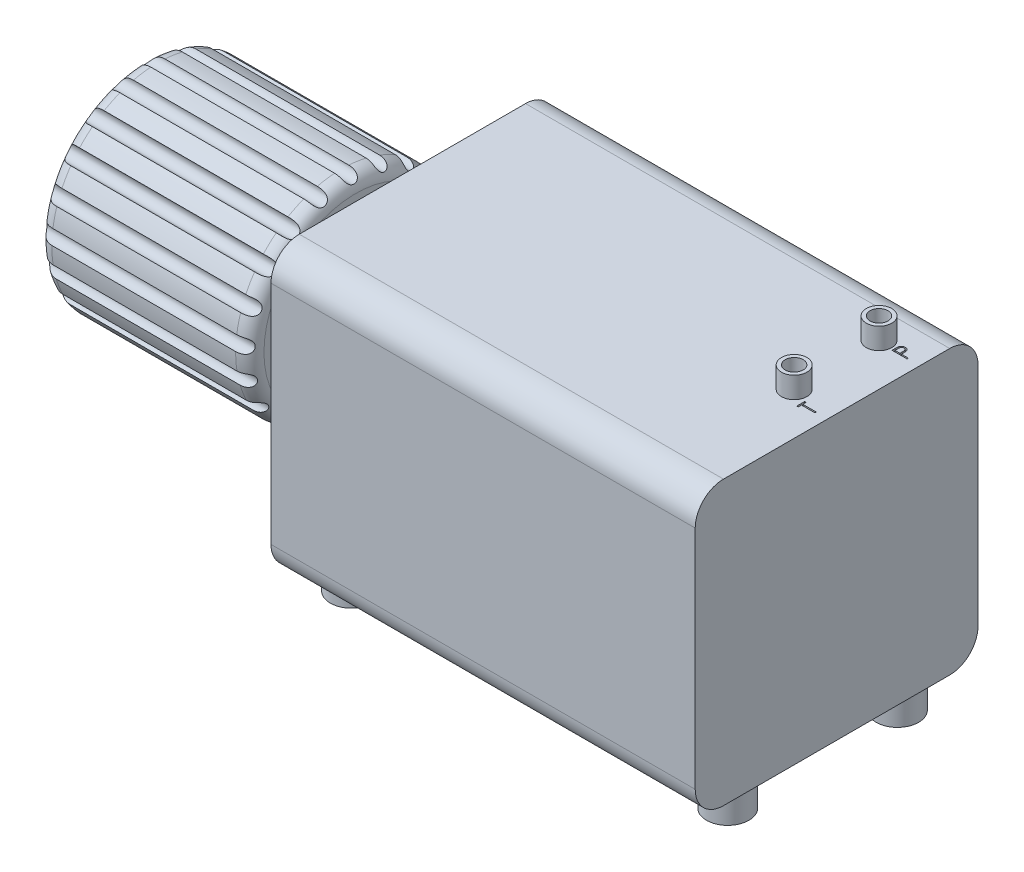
from build123d import *

# Parameters (mm, degrees)
SZKIC1_W                    = 300
SZKIC1_H                    = 200
DODANIE_WYCI_GNI_CIE1_DEPTH = 100
SZKIC2_R                    = 50
DODANIE_WYCI_GNI_CIE2_DEPTH = 40
SZKIC3_R                    = 75
DODANIE_WYCI_GNI_CIE3_DEPTH = 150
ZAOKR_GLENIE1_R             = 10
WYTNIJ_WYCI_GNI_CIE1_REACH  = 512
SZKIC4_R                    = 5
SZYK_KO_OWY1_COUNT          = 21
ZAOKR_GLENIE2_R             = 20
SZKIC5_R                    = 15
DODANIE_WYCI_GNI_CIE4_DEPTH = 20
LUSTRO2_COPY_1_SKETCH_R     = 15
LUSTRO2_COPY_1_DEPTH        = 20
SZKIC6_R                    = 9
SZKIC6_R_2                  = 6.35
DODANIE_WYCI_GNI_CIE5_DEPTH = 15
SZYK_LINIOWY1_COUNT         = 2
SZYK_LINIOWY1_PITCH         = 60
WYTNIJ_WYCI_GNI_CIE2_DEPTH  = 2
WYTNIJ_WYCI_GNI_CIE3_DEPTH  = 2


with BuildPart() as part:
    # Szkic1 → Dodanie-wyci_gni_cie1 (new, symmetric)
    with BuildSketch(Plane.XY):
        Rectangle(SZKIC1_W, SZKIC1_H)
    extrude(amount=DODANIE_WYCI_GNI_CIE1_DEPTH, both=True)

    # Szkic2 → Dodanie-wyci_gni_cie2 (add)
    with BuildSketch(Plane.ZY.offset(150)):
        with Locations(Location((0, 0, 0), (0, 0, 180))):
            Circle(SZKIC2_R)
    extrude(amount=DODANIE_WYCI_GNI_CIE2_DEPTH)

    # Szkic3 → Dodanie-wyci_gni_cie3 (add)
    with BuildSketch(Plane.ZY.offset(190)):
        Circle(SZKIC3_R)
    extrude(amount=DODANIE_WYCI_GNI_CIE3_DEPTH)

    # Zaokr_glenie1
    zaokr_glenie1_edges = [part.edges().sort_by_distance(p)[0] for p in [
        (-190, 0, -75),
        (-340, 0, -75),
    ]]
    fillet(zaokr_glenie1_edges, radius=ZAOKR_GLENIE1_R)

    # Szkic4 → Wytnij-wyci_gni_cie1 (cut, up to next)
    with BuildSketch(Plane.ZY.offset(340), mode=Mode.PRIVATE) as wytnij_wyci_gni_cie1_sk1:
        with Locations((0, 75)):
            Circle(SZKIC4_R)
    wytnij_wyci_gni_cie1_tool1 = extrude(wytnij_wyci_gni_cie1_sk1.sketch, amount=-WYTNIJ_WYCI_GNI_CIE1_REACH, mode=Mode.PRIVATE) & part.part
    wytnij_wyci_gni_cie1 = wytnij_wyci_gni_cie1_tool1.solids().sort_by_distance((-340, 75, 0))[0]
    add(wytnij_wyci_gni_cie1, mode=Mode.SUBTRACT)

    # Szyk ko_owy1: Wytnij-wyci_gni_cie1 ×21 about axis
    szyk_ko_owy1_axis = Axis((0, 0, 0), (1, 0, 0))
    for i in range(1, SZYK_KO_OWY1_COUNT):
        add(wytnij_wyci_gni_cie1.rotate(szyk_ko_owy1_axis, i * 360 / SZYK_KO_OWY1_COUNT), mode=Mode.SUBTRACT)

    # Zaokr_glenie2
    zaokr_glenie2_edges = [part.edges().sort_by_distance(p)[0] for p in [
        (0, 100, 100),
        (0, 100, -100),
        (0, -100, -100),
        (0, -100, 100),
    ]]
    fillet(zaokr_glenie2_edges, radius=ZAOKR_GLENIE2_R)

    # Szkic5 → Dodanie-wyci_gni_cie4 (add)
    with BuildSketch(Plane.XZ.offset(100)):
        with Locations(Location((-133, 60, 0), (0, 0, 180))):
            Circle(SZKIC5_R)
    dodanie_wyci_gni_cie4 = extrude(amount=DODANIE_WYCI_GNI_CIE4_DEPTH)

    # Lustro1: Dodanie-wyci_gni_cie4 across plane
    add(dodanie_wyci_gni_cie4.mirror(Plane(origin=(0, 0, 0), x_dir=(0, 0, 1), z_dir=(1, 0, 0))))

    # Lustro2: Dodanie-wyci_gni_cie4 across plane
    add(dodanie_wyci_gni_cie4.mirror(Plane.XY))

    # Lustro2 copy 1 sketch → Lustro2 copy 1 (add)
    with BuildSketch(Plane(origin=(0, -100, 0), x_dir=(-1, 0, 0), z_dir=(0, -1, 0))):
        with Locations(Location((-133, 60, 0), (0, 0, 180))):
            Circle(LUSTRO2_COPY_1_SKETCH_R)
    extrude(amount=LUSTRO2_COPY_1_DEPTH)

    # Szkic6 → Dodanie-wyci_gni_cie5 (add)
    with BuildSketch(Plane(origin=(0, 100, 0), x_dir=(1, 0, 0), z_dir=(0, 1, 0))):
        with Locations((120, 60)):
            Circle(SZKIC6_R)
        with Locations(Location((120, 60, 0), (0, 0, 180))):
            Circle(SZKIC6_R_2, mode=Mode.SUBTRACT)
    dodanie_wyci_gni_cie5 = extrude(amount=DODANIE_WYCI_GNI_CIE5_DEPTH)

    # Szyk liniowy1: Dodanie-wyci_gni_cie5 ×2
    with Locations(*[(0, 0, i * SZYK_LINIOWY1_PITCH) for i in range(1, SZYK_LINIOWY1_COUNT)]):
        add(dodanie_wyci_gni_cie5)

    # Szkic7 → Wytnij-wyci_gni_cie2 (cut)
    with BuildSketch(Plane(origin=(0, 100, 0), x_dir=(1, 0, 0), z_dir=(0, 1, 0))):
        with BuildLine():
            Line((130.705603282, 58.514607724), (130.705603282, 60.590145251))
            add(Edge.make_bspline(
                [(130.705603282, 60.590145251), (130.705760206, 60.732902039), (130.70606088, 61.006430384), (130.715176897, 61.398664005), (130.727352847, 61.754898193), (130.744231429, 62.074364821), (130.764178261, 62.358046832), (130.792154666, 62.604660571), (130.82136556, 62.816144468), (130.851063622, 62.942861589), (130.864607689, 63.000652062)],
                knots=[0, 0, 0, 0, 1.415646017, 2.712440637, 3.8905458, 4.950247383, 5.884950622, 6.709939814, 7.411656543, 8, 8, 8, 8], degree=3))
            add(Edge.make_bspline(
                [(130.864607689, 63.000652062), (130.884631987, 63.073808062), (130.924208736, 63.218396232), (131.003462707, 63.426749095), (131.097491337, 63.624937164), (131.204451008, 63.813845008), (131.329606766, 63.990031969), (131.46463253, 64.159371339), (131.618254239, 64.315885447), (131.785626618, 64.461694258), (131.964626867, 64.596461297), (132.15850719, 64.709689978), (132.361479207, 64.80869361), (132.576301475, 64.889752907), (132.803182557, 64.950031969), (133.040510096, 64.994783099), (133.288550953, 65.023318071), (133.458067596, 65.026041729), (133.544361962, 65.027428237)],
                knots=[0, 0, 0, 0, 0.999549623, 1.97554611, 2.93413192, 3.889860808, 4.833293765, 5.780583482, 6.742559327, 7.719844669, 8.705620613, 9.691528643, 10.674968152, 11.680406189, 12.713313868, 13.765869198, 14.862690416, 16, 16, 16, 16], degree=3))
            add(Edge.make_bspline(
                [(133.544361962, 65.027428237), (133.631380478, 65.026153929), (133.801638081, 65.023660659), (134.050717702, 64.993736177), (134.28874712, 64.953428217), (134.515198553, 64.891449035), (134.728727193, 64.810272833), (134.932596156, 64.715046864), (135.123337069, 64.600191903), (135.3016424, 64.468218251), (135.467679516, 64.321407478), (135.620245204, 64.160380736), (135.758446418, 63.985788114), (135.882592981, 63.798184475), (135.989806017, 63.595740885), (136.085834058, 63.381527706), (136.166482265, 63.153683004), (136.208906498, 62.996013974), (136.230476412, 62.915849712)],
                knots=[0, 0, 0, 0, 1.121902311, 2.195077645, 3.232258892, 4.234102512, 5.217864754, 6.176164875, 7.132989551, 8.084763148, 9.034132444, 9.988522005, 10.94243251, 11.903244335, 12.886203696, 13.894208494, 14.929344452, 16, 16, 16, 16], degree=3))
            add(Edge.make_bspline(
                [(136.230476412, 62.915849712), (136.24456587, 62.849544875), (136.275443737, 62.704233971), (136.310149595, 62.46493646), (136.338612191, 62.186181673), (136.365173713, 61.868918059), (136.379247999, 61.512405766), (136.395773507, 61.117462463), (136.403570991, 60.682751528), (136.404063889, 60.379554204), (136.40432123, 60.221255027)],
                knots=[0, 0, 0, 0, 0.601372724, 1.317943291, 2.144091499, 3.08771165, 4.142394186, 5.309582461, 6.595334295, 8, 8, 8, 8], degree=3))
            Line((136.40432123, 60.221255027), (136.40432123, 59.464394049))
            Line((136.40432123, 59.464394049), (141.288936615, 59.464394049))
            Line((141.288936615, 59.464394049), (141.288936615, 58.514607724))
            Line((141.288936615, 58.514607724), (130.705603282, 58.514607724))
        make_face()
        with BuildLine():
            Line((131.791073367, 59.464394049), (135.318851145, 59.464394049))
            Line((135.318851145, 59.464394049), (135.342171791, 61.317325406))
            add(Edge.make_bspline(
                [(135.342171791, 61.317325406), (135.34222161, 61.407798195), (135.342317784, 61.58245405), (135.330226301, 61.834740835), (135.316454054, 62.06884049), (135.29562433, 62.283872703), (135.268319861, 62.480591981), (135.234364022, 62.657299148), (135.197448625, 62.816637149), (135.135772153, 62.999924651), (135.040938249, 63.205945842), (134.902886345, 63.431008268), (134.724046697, 63.620269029), (134.523529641, 63.783745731), (134.301063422, 63.916028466), (134.061785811, 64.009348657), (133.809241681, 64.066811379), (133.6365363, 64.073987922), (133.54860208, 64.077641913)],
                knots=[0, 0, 0, 0, 1.160746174, 2.240796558, 3.240300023, 4.169675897, 5.012224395, 5.787635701, 6.478238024, 7.109103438, 8.265591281, 9.382545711, 10.479929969, 11.588830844, 12.694575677, 13.785760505, 14.872603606, 16, 16, 16, 16], degree=3))
            add(Edge.make_bspline(
                [(133.54860208, 64.077641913), (133.463516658, 64.073823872), (133.29437737, 64.066234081), (133.046487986, 64.009822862), (132.809922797, 63.91502638), (132.589248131, 63.783630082), (132.389172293, 63.624120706), (132.215071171, 63.438872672), (132.076047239, 63.227412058), (131.98285909, 63.032344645), (131.928300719, 62.857664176), (131.888895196, 62.706685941), (131.861722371, 62.535343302), (131.835721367, 62.345264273), (131.814733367, 62.136690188), (131.8001585, 61.908295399), (131.791718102, 61.660840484), (131.791293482, 61.489056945), (131.791073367, 61.400007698)],
                knots=[0, 0, 0, 0, 1.120540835, 2.227496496, 3.330685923, 4.466139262, 5.598993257, 6.692710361, 7.80064471, 8.921224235, 9.527843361, 10.209888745, 10.975318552, 11.811557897, 12.738105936, 13.73658638, 14.826690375, 16, 16, 16, 16], degree=3))
            Line((131.791073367, 61.400007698), (131.791073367, 59.464394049))
        make_face(mode=Mode.SUBTRACT)
    extrude(amount=-WYTNIJ_WYCI_GNI_CIE2_DEPTH, mode=Mode.SUBTRACT)

    # Szkic8 → Wytnij-wyci_gni_cie3 (cut)
    with BuildSketch(Plane(origin=(0, 100, 0), x_dir=(1, 0, 0), z_dir=(0, 1, 0))):
        Polygon((132.261355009, -9.376446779), (131.175884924, -9.376446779), (131.175884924, -3.813412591), (132.261355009, -3.813412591), (132.261355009, -6.120036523), (141.759218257, -6.120036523), (141.759218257, -7.069822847), (132.261355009, -7.069822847), align=None)
    extrude(amount=-WYTNIJ_WYCI_GNI_CIE3_DEPTH, mode=Mode.SUBTRACT)


solid = part.part
